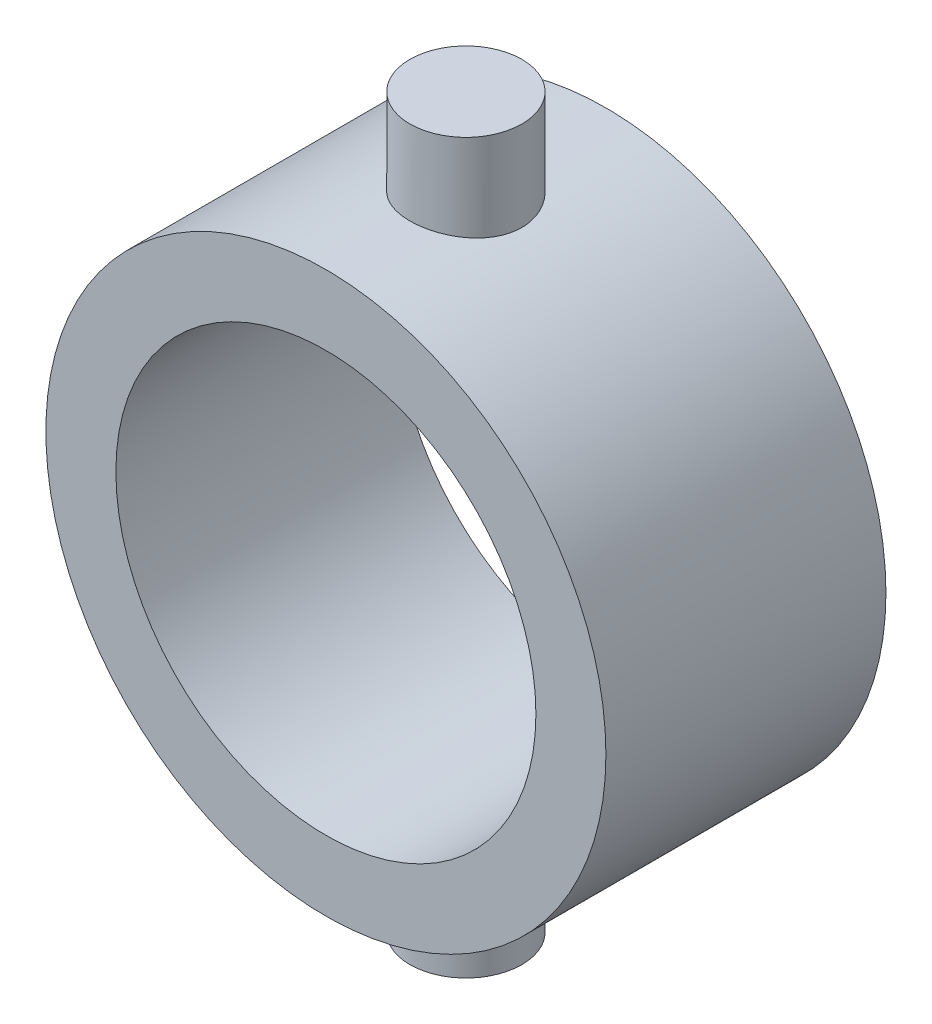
from build123d import *

# Parameters (mm, degrees)
SKETCH2_R           = 10
BOSS_EXTRUDE1_DEPTH = 10
SKETCH3_R           = 7.5
CUT_EXTRUDE1_DEPTH  = 20
SKETCH4_R           = 2
BOSS_EXTRUDE2_DEPTH = 13
SKETCH5_R           = 7.5
CUT_EXTRUDE2_DEPTH  = 30


with BuildPart() as part:
    # Sketch2 → Boss-Extrude1 (new body)
    with BuildSketch(Plane.XY):
        Circle(SKETCH2_R)
    extrude(amount=BOSS_EXTRUDE1_DEPTH)

    # Sketch3 → Cut-Extrude1 (cut)
    with BuildSketch(Plane.XY.offset(10)):
        Circle(SKETCH3_R)
    extrude(amount=-CUT_EXTRUDE1_DEPTH, mode=Mode.SUBTRACT)

    # Sketch4 → Boss-Extrude2 (add, symmetric)
    with BuildSketch(Plane(origin=(0, 0, 0), x_dir=(1, 0, 0), z_dir=(0, 1, 0))):
        with Locations(Location((0, -5, 0), (0, 0, 90))):
            Circle(SKETCH4_R)
    extrude(amount=BOSS_EXTRUDE2_DEPTH, both=True)

    # Sketch5 → Cut-Extrude2 (cut)
    with BuildSketch(Plane.XY.offset(10)):
        Circle(SKETCH5_R)
    extrude(amount=-CUT_EXTRUDE2_DEPTH, mode=Mode.SUBTRACT)


solid = part.part
